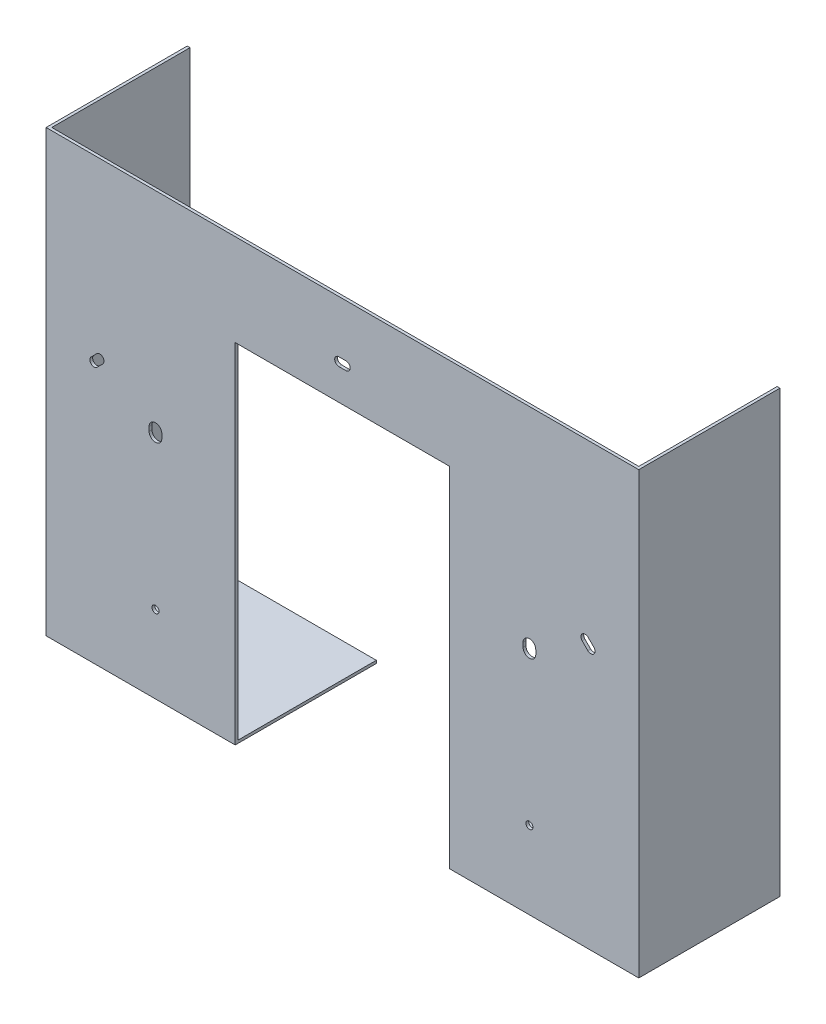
ISO-10303-21;
HEADER;
FILE_DESCRIPTION(('STEP AP214'),'2;1');
FILE_NAME('part.step','',(''),(''),'','','');
FILE_SCHEMA(('AUTOMOTIVE_DESIGN { 1 0 10303 214 1 1 1 1 }'));
ENDSEC;
DATA;
#1=APPLICATION_CONTEXT('core data for automotive mechanical design processes');
#2=APPLICATION_PROTOCOL_DEFINITION('international standard','automotive_design',2000,#1);
#3=PRODUCT_CONTEXT('',#1,'mechanical');
#4=PRODUCT('Part','Part','',(#3));
#5=PRODUCT_RELATED_PRODUCT_CATEGORY('part','',(#4));
#6=PRODUCT_DEFINITION_FORMATION('','',#4);
#7=PRODUCT_DEFINITION_CONTEXT('part definition',#1,'design');
#8=PRODUCT_DEFINITION('design','',#6,#7);
#9=PRODUCT_DEFINITION_SHAPE('','',#8);
#10=(LENGTH_UNIT() NAMED_UNIT(*) SI_UNIT(.MILLI.,.METRE.));
#11=(NAMED_UNIT(*) PLANE_ANGLE_UNIT() SI_UNIT($,.RADIAN.));
#12=(NAMED_UNIT(*) SI_UNIT($,.STERADIAN.) SOLID_ANGLE_UNIT());
#13=UNCERTAINTY_MEASURE_WITH_UNIT(LENGTH_MEASURE(1.E-05),#10,'distance_accuracy_value','');
#14=(GEOMETRIC_REPRESENTATION_CONTEXT(3) GLOBAL_UNCERTAINTY_ASSIGNED_CONTEXT((#13)) GLOBAL_UNIT_ASSIGNED_CONTEXT((#10,
#11,#12)) REPRESENTATION_CONTEXT('',''));
#15=CARTESIAN_POINT('',(0.,0.,0.));
#16=DIRECTION('',(0.,0.,1.));
#17=DIRECTION('',(1.,0.,0.));
#18=AXIS2_PLACEMENT_3D('',#15,#16,#17);
#19=CARTESIAN_POINT('',(0.,312.,0.));
#20=DIRECTION('',(0.,0.,-1.));
#21=DIRECTION('',(-1.,0.,0.));
#22=AXIS2_PLACEMENT_3D('',#19,#20,#21);
#23=PLANE('',#22);
#24=DIRECTION('',(0.,-1.,0.));
#25=VECTOR('',#24,1.);
#26=CARTESIAN_POINT('',(134.,247.,0.));
#27=LINE('',#26,#25);
#28=CARTESIAN_POINT('',(134.,2.,0.));
#29=VERTEX_POINT('',#28);
#30=CARTESIAN_POINT('',(134.,0.,0.));
#31=VERTEX_POINT('',#30);
#32=EDGE_CURVE('E458',#29,#31,#27,.T.);
#33=ORIENTED_EDGE('',*,*,#32,.T.);
#34=DIRECTION('',(1.,0.,0.));
#35=VECTOR('',#34,1.);
#36=CARTESIAN_POINT('',(0.,0.,0.));
#37=LINE('',#36,#35);
#38=CARTESIAN_POINT('',(0.,0.,0.));
#39=VERTEX_POINT('',#38);
#40=EDGE_CURVE('E515',#39,#31,#37,.T.);
#41=ORIENTED_EDGE('',*,*,#40,.F.);
#42=DIRECTION('',(0.,-1.,0.));
#43=VECTOR('',#42,1.);
#44=CARTESIAN_POINT('',(0.,0.,0.));
#45=LINE('',#44,#43);
#46=CARTESIAN_POINT('',(0.,312.,0.));
#47=VERTEX_POINT('',#46);
#48=EDGE_CURVE('E482',#47,#39,#45,.T.);
#49=ORIENTED_EDGE('',*,*,#48,.F.);
#50=DIRECTION('',(-1.,0.,0.));
#51=VECTOR('',#50,1.);
#52=CARTESIAN_POINT('',(0.,312.,0.));
#53=LINE('',#52,#51);
#54=CARTESIAN_POINT('',(2.,312.,0.));
#55=VERTEX_POINT('',#54);
#56=EDGE_CURVE('E520',#55,#47,#53,.T.);
#57=ORIENTED_EDGE('',*,*,#56,.F.);
#58=DIRECTION('',(0.,-1.,0.));
#59=VECTOR('',#58,1.);
#60=CARTESIAN_POINT('',(2.,312.,0.));
#61=LINE('',#60,#59);
#62=CARTESIAN_POINT('',(2.,2.,0.));
#63=VERTEX_POINT('',#62);
#64=EDGE_CURVE('E478',#55,#63,#61,.T.);
#65=ORIENTED_EDGE('',*,*,#64,.T.);
#66=DIRECTION('',(1.,0.,0.));
#67=VECTOR('',#66,1.);
#68=CARTESIAN_POINT('',(0.,2.,0.));
#69=LINE('',#68,#67);
#70=EDGE_CURVE('E509',#63,#29,#69,.T.);
#71=ORIENTED_EDGE('',*,*,#70,.T.);
#72=EDGE_LOOP('',(#33,#41,#49,#57,#65,#71));
#73=FACE_BOUND('',#72,.T.);
#74=ADVANCED_FACE('F26',(#73),#23,.T.);
#75=CARTESIAN_POINT('',(0.,0.,100.));
#76=DIRECTION('',(0.,1.,0.));
#77=DIRECTION('',(0.,0.,1.));
#78=AXIS2_PLACEMENT_3D('',#75,#76,#77);
#79=PLANE('',#78);
#80=DIRECTION('',(0.,0.,-1.));
#81=VECTOR('',#80,1.);
#82=CARTESIAN_POINT('',(79.,0.,76.));
#83=LINE('',#82,#81);
#84=CARTESIAN_POINT('',(79.,0.,76.));
#85=VERTEX_POINT('',#84);
#86=CARTESIAN_POINT('',(79.,0.,67.));
#87=VERTEX_POINT('',#86);
#88=EDGE_CURVE('E324',#85,#87,#83,.T.);
#89=ORIENTED_EDGE('',*,*,#88,.F.);
#90=CARTESIAN_POINT('',(85.,0.,76.));
#91=DIRECTION('',(0.,-1.,0.));
#92=DIRECTION('',(0.,0.,-1.));
#93=AXIS2_PLACEMENT_3D('',#90,#91,#92);
#94=CIRCLE('',#93,6.00000000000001);
#95=CARTESIAN_POINT('',(91.,0.,76.));
#96=VERTEX_POINT('',#95);
#97=EDGE_CURVE('E320',#96,#85,#94,.T.);
#98=ORIENTED_EDGE('',*,*,#97,.F.);
#99=DIRECTION('',(0.,0.,1.));
#100=VECTOR('',#99,1.);
#101=CARTESIAN_POINT('',(91.,0.,76.));
#102=LINE('',#101,#100);
#103=CARTESIAN_POINT('',(91.,0.,67.));
#104=VERTEX_POINT('',#103);
#105=EDGE_CURVE('E330',#104,#96,#102,.T.);
#106=ORIENTED_EDGE('',*,*,#105,.F.);
#107=CARTESIAN_POINT('',(85.,0.,67.));
#108=DIRECTION('',(0.,-1.,0.));
#109=DIRECTION('',(0.,0.,-1.));
#110=AXIS2_PLACEMENT_3D('',#107,#108,#109);
#111=CIRCLE('',#110,6.00000000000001);
#112=EDGE_CURVE('E327',#87,#104,#111,.T.);
#113=ORIENTED_EDGE('',*,*,#112,.F.);
#114=EDGE_LOOP('',(#89,#98,#106,#113));
#115=FACE_BOUND('',#114,.T.);
#116=ORIENTED_EDGE('',*,*,#40,.T.);
#117=DIRECTION('',(0.,0.,1.));
#118=VECTOR('',#117,1.);
#119=CARTESIAN_POINT('',(134.,0.,100.));
#120=LINE('',#119,#118);
#121=CARTESIAN_POINT('',(134.,0.,100.));
#122=VERTEX_POINT('',#121);
#123=EDGE_CURVE('E475',#31,#122,#120,.T.);
#124=ORIENTED_EDGE('',*,*,#123,.T.);
#125=DIRECTION('',(1.,0.,0.));
#126=VECTOR('',#125,1.);
#127=CARTESIAN_POINT('',(0.,0.,100.));
#128=LINE('',#127,#126);
#129=CARTESIAN_POINT('',(0.,0.,100.));
#130=VERTEX_POINT('',#129);
#131=EDGE_CURVE('E528',#130,#122,#128,.T.);
#132=ORIENTED_EDGE('',*,*,#131,.F.);
#133=DIRECTION('',(0.,0.,-1.));
#134=VECTOR('',#133,1.);
#135=CARTESIAN_POINT('',(0.,0.,100.));
#136=LINE('',#135,#134);
#137=EDGE_CURVE('E544',#130,#39,#136,.T.);
#138=ORIENTED_EDGE('',*,*,#137,.T.);
#139=EDGE_LOOP('',(#116,#124,#132,#138));
#140=FACE_BOUND('',#139,.T.);
#141=ADVANCED_FACE('F637',(#115,#140),#79,.F.);
#142=CARTESIAN_POINT('',(0.,2.,100.));
#143=DIRECTION('',(0.,1.,0.));
#144=DIRECTION('',(0.,0.,1.));
#145=AXIS2_PLACEMENT_3D('',#142,#143,#144);
#146=PLANE('',#145);
#147=CARTESIAN_POINT('',(85.,2.,76.));
#148=DIRECTION('',(0.,1.,0.));
#149=DIRECTION('',(0.,0.,1.));
#150=AXIS2_PLACEMENT_3D('',#147,#148,#149);
#151=CIRCLE('',#150,6.00000000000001);
#152=CARTESIAN_POINT('',(79.,2.,76.));
#153=VERTEX_POINT('',#152);
#154=CARTESIAN_POINT('',(91.,2.,76.));
#155=VERTEX_POINT('',#154);
#156=EDGE_CURVE('E610',#153,#155,#151,.T.);
#157=ORIENTED_EDGE('',*,*,#156,.F.);
#158=DIRECTION('',(0.,0.,1.));
#159=VECTOR('',#158,1.);
#160=CARTESIAN_POINT('',(79.,2.,100.));
#161=LINE('',#160,#159);
#162=CARTESIAN_POINT('',(79.,2.,67.));
#163=VERTEX_POINT('',#162);
#164=EDGE_CURVE('E603',#163,#153,#161,.T.);
#165=ORIENTED_EDGE('',*,*,#164,.F.);
#166=CARTESIAN_POINT('',(85.,2.,67.));
#167=DIRECTION('',(0.,1.,0.));
#168=DIRECTION('',(0.,0.,1.));
#169=AXIS2_PLACEMENT_3D('',#166,#167,#168);
#170=CIRCLE('',#169,6.00000000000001);
#171=CARTESIAN_POINT('',(91.,2.,67.));
#172=VERTEX_POINT('',#171);
#173=EDGE_CURVE('E605',#172,#163,#170,.T.);
#174=ORIENTED_EDGE('',*,*,#173,.F.);
#175=DIRECTION('',(0.,0.,-1.));
#176=VECTOR('',#175,1.);
#177=CARTESIAN_POINT('',(91.,2.,100.));
#178=LINE('',#177,#176);
#179=EDGE_CURVE('E608',#155,#172,#178,.T.);
#180=ORIENTED_EDGE('',*,*,#179,.F.);
#181=EDGE_LOOP('',(#157,#165,#174,#180));
#182=FACE_BOUND('',#181,.T.);
#183=DIRECTION('',(0.,0.,1.));
#184=VECTOR('',#183,1.);
#185=CARTESIAN_POINT('',(134.,2.,100.));
#186=LINE('',#185,#184);
#187=CARTESIAN_POINT('',(134.,1.99999999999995,98.));
#188=VERTEX_POINT('',#187);
#189=EDGE_CURVE('E473',#29,#188,#186,.T.);
#190=ORIENTED_EDGE('',*,*,#189,.F.);
#191=ORIENTED_EDGE('',*,*,#70,.F.);
#192=DIRECTION('',(0.,0.,-1.));
#193=VECTOR('',#192,1.);
#194=CARTESIAN_POINT('',(2.,2.,100.));
#195=LINE('',#194,#193);
#196=CARTESIAN_POINT('',(2.,2.,98.));
#197=VERTEX_POINT('',#196);
#198=EDGE_CURVE('E479',#197,#63,#195,.T.);
#199=ORIENTED_EDGE('',*,*,#198,.F.);
#200=DIRECTION('',(1.,0.,0.));
#201=VECTOR('',#200,1.);
#202=CARTESIAN_POINT('',(0.,2.,98.));
#203=LINE('',#202,#201);
#204=EDGE_CURVE('E492',#197,#188,#203,.T.);
#205=ORIENTED_EDGE('',*,*,#204,.T.);
#206=EDGE_LOOP('',(#190,#191,#199,#205));
#207=FACE_BOUND('',#206,.T.);
#208=ADVANCED_FACE('F646',(#182,#207),#146,.T.);
#209=DIRECTION('',(0.,1.,0.));
#210=VECTOR('',#209,1.);
#211=CARTESIAN_POINT('',(286.,247.,0.));
#212=LINE('',#211,#210);
#213=CARTESIAN_POINT('',(286.,0.,0.));
#214=VERTEX_POINT('',#213);
#215=CARTESIAN_POINT('',(286.,2.,0.));
#216=VERTEX_POINT('',#215);
#217=EDGE_CURVE('E461',#214,#216,#212,.T.);
#218=ORIENTED_EDGE('',*,*,#217,.T.);
#219=CARTESIAN_POINT('',(418.,2.,0.));
#220=VERTEX_POINT('',#219);
#221=EDGE_CURVE('E500',#216,#220,#69,.T.);
#222=ORIENTED_EDGE('',*,*,#221,.T.);
#223=DIRECTION('',(0.,1.,0.));
#224=VECTOR('',#223,1.);
#225=CARTESIAN_POINT('',(418.,312.,0.));
#226=LINE('',#225,#224);
#227=CARTESIAN_POINT('',(418.,312.,0.));
#228=VERTEX_POINT('',#227);
#229=EDGE_CURVE('E488',#220,#228,#226,.T.);
#230=ORIENTED_EDGE('',*,*,#229,.T.);
#231=CARTESIAN_POINT('',(420.,312.,0.));
#232=VERTEX_POINT('',#231);
#233=EDGE_CURVE('E521',#232,#228,#53,.T.);
#234=ORIENTED_EDGE('',*,*,#233,.F.);
#235=DIRECTION('',(0.,1.,0.));
#236=VECTOR('',#235,1.);
#237=CARTESIAN_POINT('',(420.,0.,0.));
#238=LINE('',#237,#236);
#239=CARTESIAN_POINT('',(420.,0.,0.));
#240=VERTEX_POINT('',#239);
#241=EDGE_CURVE('E518',#240,#232,#238,.T.);
#242=ORIENTED_EDGE('',*,*,#241,.F.);
#243=EDGE_CURVE('E514',#214,#240,#37,.T.);
#244=ORIENTED_EDGE('',*,*,#243,.F.);
#245=EDGE_LOOP('',(#218,#222,#230,#234,#242,#244));
#246=FACE_BOUND('',#245,.T.);
#247=ADVANCED_FACE('F640',(#246),#23,.T.);
#248=CARTESIAN_POINT('',(0.,0.,100.));
#249=DIRECTION('',(1.,0.,0.));
#250=DIRECTION('',(0.,0.,-1.));
#251=AXIS2_PLACEMENT_3D('',#248,#249,#250);
#252=PLANE('',#251);
#253=ORIENTED_EDGE('',*,*,#48,.T.);
#254=ORIENTED_EDGE('',*,*,#137,.F.);
#255=DIRECTION('',(0.,-1.,0.));
#256=VECTOR('',#255,1.);
#257=CARTESIAN_POINT('',(0.,0.,100.));
#258=LINE('',#257,#256);
#259=CARTESIAN_POINT('',(0.,312.,100.));
#260=VERTEX_POINT('',#259);
#261=EDGE_CURVE('E524',#260,#130,#258,.T.);
#262=ORIENTED_EDGE('',*,*,#261,.F.);
#263=DIRECTION('',(0.,0.,-1.));
#264=VECTOR('',#263,1.);
#265=CARTESIAN_POINT('',(0.,312.,100.));
#266=LINE('',#265,#264);
#267=EDGE_CURVE('E535',#260,#47,#266,.T.);
#268=ORIENTED_EDGE('',*,*,#267,.T.);
#269=EDGE_LOOP('',(#253,#254,#262,#268));
#270=FACE_BOUND('',#269,.T.);
#271=ADVANCED_FACE('F28',(#270),#252,.F.);
#272=DIRECTION('',(0.,0.,-1.));
#273=VECTOR('',#272,1.);
#274=CARTESIAN_POINT('',(329.,0.,76.));
#275=LINE('',#274,#273);
#276=CARTESIAN_POINT('',(329.,0.,76.));
#277=VERTEX_POINT('',#276);
#278=CARTESIAN_POINT('',(329.,0.,67.));
#279=VERTEX_POINT('',#278);
#280=EDGE_CURVE('E306',#277,#279,#275,.T.);
#281=ORIENTED_EDGE('',*,*,#280,.F.);
#282=CARTESIAN_POINT('',(335.,0.,76.));
#283=DIRECTION('',(0.,-1.,0.));
#284=DIRECTION('',(0.,0.,-1.));
#285=AXIS2_PLACEMENT_3D('',#282,#283,#284);
#286=CIRCLE('',#285,6.00000000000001);
#287=CARTESIAN_POINT('',(341.,0.,76.));
#288=VERTEX_POINT('',#287);
#289=EDGE_CURVE('E41',#288,#277,#286,.T.);
#290=ORIENTED_EDGE('',*,*,#289,.F.);
#291=DIRECTION('',(0.,0.,1.));
#292=VECTOR('',#291,1.);
#293=CARTESIAN_POINT('',(341.,0.,76.));
#294=LINE('',#293,#292);
#295=CARTESIAN_POINT('',(341.,0.,67.));
#296=VERTEX_POINT('',#295);
#297=EDGE_CURVE('E313',#296,#288,#294,.T.);
#298=ORIENTED_EDGE('',*,*,#297,.F.);
#299=CARTESIAN_POINT('',(335.,0.,67.));
#300=DIRECTION('',(0.,-1.,0.));
#301=DIRECTION('',(0.,0.,-1.));
#302=AXIS2_PLACEMENT_3D('',#299,#300,#301);
#303=CIRCLE('',#302,6.00000000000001);
#304=EDGE_CURVE('E297',#279,#296,#303,.T.);
#305=ORIENTED_EDGE('',*,*,#304,.F.);
#306=EDGE_LOOP('',(#281,#290,#298,#305));
#307=FACE_BOUND('',#306,.T.);
#308=CARTESIAN_POINT('',(286.,0.,100.));
#309=VERTEX_POINT('',#308);
#310=CARTESIAN_POINT('',(420.,0.,100.));
#311=VERTEX_POINT('',#310);
#312=EDGE_CURVE('E527',#309,#311,#128,.T.);
#313=ORIENTED_EDGE('',*,*,#312,.F.);
#314=DIRECTION('',(0.,0.,-1.));
#315=VECTOR('',#314,1.);
#316=CARTESIAN_POINT('',(286.,0.,100.));
#317=LINE('',#316,#315);
#318=EDGE_CURVE('E470',#309,#214,#317,.T.);
#319=ORIENTED_EDGE('',*,*,#318,.T.);
#320=ORIENTED_EDGE('',*,*,#243,.T.);
#321=DIRECTION('',(0.,0.,-1.));
#322=VECTOR('',#321,1.);
#323=CARTESIAN_POINT('',(420.,0.,100.));
#324=LINE('',#323,#322);
#325=EDGE_CURVE('E541',#311,#240,#324,.T.);
#326=ORIENTED_EDGE('',*,*,#325,.F.);
#327=EDGE_LOOP('',(#313,#319,#320,#326));
#328=FACE_BOUND('',#327,.T.);
#329=ADVANCED_FACE('F310',(#307,#328),#79,.F.);
#330=CARTESIAN_POINT('',(420.,0.,100.));
#331=DIRECTION('',(-1.,0.,0.));
#332=DIRECTION('',(0.,0.,1.));
#333=AXIS2_PLACEMENT_3D('',#330,#331,#332);
#334=PLANE('',#333);
#335=ORIENTED_EDGE('',*,*,#241,.T.);
#336=DIRECTION('',(0.,0.,-1.));
#337=VECTOR('',#336,1.);
#338=CARTESIAN_POINT('',(420.,312.,100.));
#339=LINE('',#338,#337);
#340=CARTESIAN_POINT('',(420.,312.,100.));
#341=VERTEX_POINT('',#340);
#342=EDGE_CURVE('E538',#341,#232,#339,.T.);
#343=ORIENTED_EDGE('',*,*,#342,.F.);
#344=DIRECTION('',(0.,1.,0.));
#345=VECTOR('',#344,1.);
#346=CARTESIAN_POINT('',(420.,0.,100.));
#347=LINE('',#346,#345);
#348=EDGE_CURVE('E531',#311,#341,#347,.T.);
#349=ORIENTED_EDGE('',*,*,#348,.F.);
#350=ORIENTED_EDGE('',*,*,#325,.T.);
#351=EDGE_LOOP('',(#335,#343,#349,#350));
#352=FACE_BOUND('',#351,.T.);
#353=ADVANCED_FACE('F682',(#352),#334,.F.);
#354=CARTESIAN_POINT('',(0.,312.,100.));
#355=DIRECTION('',(0.,-1.,0.));
#356=DIRECTION('',(0.,0.,-1.));
#357=AXIS2_PLACEMENT_3D('',#354,#355,#356);
#358=PLANE('',#357);
#359=DIRECTION('',(-1.,0.,0.));
#360=VECTOR('',#359,1.);
#361=CARTESIAN_POINT('',(0.,312.,98.));
#362=LINE('',#361,#360);
#363=CARTESIAN_POINT('',(418.,312.,98.));
#364=VERTEX_POINT('',#363);
#365=CARTESIAN_POINT('',(2.,312.,98.));
#366=VERTEX_POINT('',#365);
#367=EDGE_CURVE('E497',#364,#366,#362,.T.);
#368=ORIENTED_EDGE('',*,*,#367,.T.);
#369=DIRECTION('',(0.,0.,-1.));
#370=VECTOR('',#369,1.);
#371=CARTESIAN_POINT('',(2.,312.,100.));
#372=LINE('',#371,#370);
#373=EDGE_CURVE('E501',#366,#55,#372,.T.);
#374=ORIENTED_EDGE('',*,*,#373,.T.);
#375=ORIENTED_EDGE('',*,*,#56,.T.);
#376=ORIENTED_EDGE('',*,*,#267,.F.);
#377=DIRECTION('',(-1.,0.,0.));
#378=VECTOR('',#377,1.);
#379=CARTESIAN_POINT('',(0.,312.,100.));
#380=LINE('',#379,#378);
#381=EDGE_CURVE('E533',#341,#260,#380,.T.);
#382=ORIENTED_EDGE('',*,*,#381,.F.);
#383=ORIENTED_EDGE('',*,*,#342,.T.);
#384=ORIENTED_EDGE('',*,*,#233,.T.);
#385=DIRECTION('',(0.,0.,-1.));
#386=VECTOR('',#385,1.);
#387=CARTESIAN_POINT('',(418.,312.,100.));
#388=LINE('',#387,#386);
#389=EDGE_CURVE('E491',#364,#228,#388,.T.);
#390=ORIENTED_EDGE('',*,*,#389,.F.);
#391=EDGE_LOOP('',(#368,#374,#375,#376,#382,#383,#384,#390));
#392=FACE_BOUND('',#391,.T.);
#393=ADVANCED_FACE('F678',(#392),#358,.F.);
#394=CARTESIAN_POINT('',(0.,312.,100.));
#395=DIRECTION('',(0.,0.,-1.));
#396=DIRECTION('',(-1.,0.,0.));
#397=AXIS2_PLACEMENT_3D('',#394,#395,#396);
#398=PLANE('',#397);
#399=DIRECTION('',(0.707106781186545,0.70710678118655,0.));
#400=VECTOR('',#399,1.);
#401=CARTESIAN_POINT('',(36.1213203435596,182.87867965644,100.));
#402=LINE('',#401,#400);
#403=CARTESIAN_POINT('',(36.1213203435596,182.87867965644,100.));
#404=VERTEX_POINT('',#403);
#405=CARTESIAN_POINT('',(40.1213203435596,186.87867965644,100.));
#406=VERTEX_POINT('',#405);
#407=EDGE_CURVE('E344',#404,#406,#402,.T.);
#408=ORIENTED_EDGE('',*,*,#407,.F.);
#409=CARTESIAN_POINT('',(34.,185.,100.));
#410=DIRECTION('',(0.,0.,1.));
#411=DIRECTION('',(1.,0.,0.));
#412=AXIS2_PLACEMENT_3D('',#409,#410,#411);
#413=CIRCLE('',#412,3.);
#414=CARTESIAN_POINT('',(31.8786796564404,187.12132034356,100.));
#415=VERTEX_POINT('',#414);
#416=EDGE_CURVE('E336',#415,#404,#413,.T.);
#417=ORIENTED_EDGE('',*,*,#416,.F.);
#418=DIRECTION('',(-0.707106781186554,-0.707106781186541,0.));
#419=VECTOR('',#418,1.);
#420=CARTESIAN_POINT('',(31.8786796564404,187.12132034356,100.));
#421=LINE('',#420,#419);
#422=CARTESIAN_POINT('',(35.8786796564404,191.12132034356,100.));
#423=VERTEX_POINT('',#422);
#424=EDGE_CURVE('E350',#423,#415,#421,.T.);
#425=ORIENTED_EDGE('',*,*,#424,.F.);
#426=CARTESIAN_POINT('',(38.,189.,100.));
#427=DIRECTION('',(0.,0.,1.));
#428=DIRECTION('',(1.,0.,0.));
#429=AXIS2_PLACEMENT_3D('',#426,#427,#428);
#430=CIRCLE('',#429,2.99999999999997);
#431=EDGE_CURVE('E347',#406,#423,#430,.T.);
#432=ORIENTED_EDGE('',*,*,#431,.F.);
#433=EDGE_LOOP('',(#408,#417,#425,#432));
#434=FACE_BOUND('',#433,.T.);
#435=DIRECTION('',(-0.707106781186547,0.707106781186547,0.));
#436=VECTOR('',#435,1.);
#437=CARTESIAN_POINT('',(388.12132034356,187.12132034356,100.));
#438=LINE('',#437,#436);
#439=CARTESIAN_POINT('',(388.12132034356,187.12132034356,100.));
#440=VERTEX_POINT('',#439);
#441=CARTESIAN_POINT('',(384.12132034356,191.12132034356,100.));
#442=VERTEX_POINT('',#441);
#443=EDGE_CURVE('E364',#440,#442,#438,.T.);
#444=ORIENTED_EDGE('',*,*,#443,.F.);
#445=CARTESIAN_POINT('',(386.,185.,100.));
#446=DIRECTION('',(0.,0.,1.));
#447=DIRECTION('',(-1.,0.,0.));
#448=AXIS2_PLACEMENT_3D('',#445,#446,#447);
#449=CIRCLE('',#448,3.);
#450=CARTESIAN_POINT('',(383.87867965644,182.87867965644,100.));
#451=VERTEX_POINT('',#450);
#452=EDGE_CURVE('E356',#451,#440,#449,.T.);
#453=ORIENTED_EDGE('',*,*,#452,.F.);
#454=DIRECTION('',(0.707106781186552,-0.707106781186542,0.));
#455=VECTOR('',#454,1.);
#456=CARTESIAN_POINT('',(383.87867965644,182.87867965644,100.));
#457=LINE('',#456,#455);
#458=CARTESIAN_POINT('',(379.87867965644,186.87867965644,100.));
#459=VERTEX_POINT('',#458);
#460=EDGE_CURVE('E370',#459,#451,#457,.T.);
#461=ORIENTED_EDGE('',*,*,#460,.F.);
#462=CARTESIAN_POINT('',(382.,189.,100.));
#463=DIRECTION('',(0.,0.,1.));
#464=DIRECTION('',(-1.,0.,0.));
#465=AXIS2_PLACEMENT_3D('',#462,#463,#464);
#466=CIRCLE('',#465,3.00000000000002);
#467=EDGE_CURVE('E367',#442,#459,#466,.T.);
#468=ORIENTED_EDGE('',*,*,#467,.F.);
#469=EDGE_LOOP('',(#444,#453,#461,#468));
#470=FACE_BOUND('',#469,.T.);
#471=DIRECTION('',(1.,0.,0.));
#472=VECTOR('',#471,1.);
#473=CARTESIAN_POINT('',(207.5,269.,100.));
#474=LINE('',#473,#472);
#475=CARTESIAN_POINT('',(207.5,269.,100.));
#476=VERTEX_POINT('',#475);
#477=CARTESIAN_POINT('',(212.5,269.,100.));
#478=VERTEX_POINT('',#477);
#479=EDGE_CURVE('E384',#476,#478,#474,.T.);
#480=ORIENTED_EDGE('',*,*,#479,.F.);
#481=CARTESIAN_POINT('',(207.5,272.,100.));
#482=DIRECTION('',(0.,0.,1.));
#483=DIRECTION('',(1.,0.,0.));
#484=AXIS2_PLACEMENT_3D('',#481,#482,#483);
#485=CIRCLE('',#484,3.);
#486=CARTESIAN_POINT('',(207.5,275.,100.));
#487=VERTEX_POINT('',#486);
#488=EDGE_CURVE('E376',#487,#476,#485,.T.);
#489=ORIENTED_EDGE('',*,*,#488,.F.);
#490=DIRECTION('',(-1.,0.,0.));
#491=VECTOR('',#490,1.);
#492=CARTESIAN_POINT('',(207.5,275.,100.));
#493=LINE('',#492,#491);
#494=CARTESIAN_POINT('',(212.5,275.,100.));
#495=VERTEX_POINT('',#494);
#496=EDGE_CURVE('E390',#495,#487,#493,.T.);
#497=ORIENTED_EDGE('',*,*,#496,.F.);
#498=CARTESIAN_POINT('',(212.5,272.,100.));
#499=DIRECTION('',(0.,0.,1.));
#500=DIRECTION('',(1.,0.,0.));
#501=AXIS2_PLACEMENT_3D('',#498,#499,#500);
#502=CIRCLE('',#501,3.);
#503=EDGE_CURVE('E387',#478,#495,#502,.T.);
#504=ORIENTED_EDGE('',*,*,#503,.F.);
#505=EDGE_LOOP('',(#480,#489,#497,#504));
#506=FACE_BOUND('',#505,.T.);
#507=DIRECTION('',(0.,-1.,0.));
#508=VECTOR('',#507,1.);
#509=CARTESIAN_POINT('',(338.,165.,100.));
#510=LINE('',#509,#508);
#511=CARTESIAN_POINT('',(338.,165.,100.));
#512=VERTEX_POINT('',#511);
#513=CARTESIAN_POINT('',(338.,162.,100.));
#514=VERTEX_POINT('',#513);
#515=EDGE_CURVE('E404',#512,#514,#510,.T.);
#516=ORIENTED_EDGE('',*,*,#515,.F.);
#517=CARTESIAN_POINT('',(342.5,165.,100.));
#518=DIRECTION('',(0.,0.,1.));
#519=DIRECTION('',(1.,0.,0.));
#520=AXIS2_PLACEMENT_3D('',#517,#518,#519);
#521=CIRCLE('',#520,4.5);
#522=CARTESIAN_POINT('',(347.,165.,100.));
#523=VERTEX_POINT('',#522);
#524=EDGE_CURVE('E396',#523,#512,#521,.T.);
#525=ORIENTED_EDGE('',*,*,#524,.F.);
#526=DIRECTION('',(0.,1.,0.));
#527=VECTOR('',#526,1.);
#528=CARTESIAN_POINT('',(347.,165.,100.));
#529=LINE('',#528,#527);
#530=CARTESIAN_POINT('',(347.,162.,100.));
#531=VERTEX_POINT('',#530);
#532=EDGE_CURVE('E410',#531,#523,#529,.T.);
#533=ORIENTED_EDGE('',*,*,#532,.F.);
#534=CARTESIAN_POINT('',(342.5,162.,100.));
#535=DIRECTION('',(0.,0.,1.));
#536=DIRECTION('',(1.,0.,0.));
#537=AXIS2_PLACEMENT_3D('',#534,#535,#536);
#538=CIRCLE('',#537,4.5);
#539=EDGE_CURVE('E407',#514,#531,#538,.T.);
#540=ORIENTED_EDGE('',*,*,#539,.F.);
#541=EDGE_LOOP('',(#516,#525,#533,#540));
#542=FACE_BOUND('',#541,.T.);
#543=DIRECTION('',(0.,-1.,0.));
#544=VECTOR('',#543,1.);
#545=CARTESIAN_POINT('',(73.,165.,100.));
#546=LINE('',#545,#544);
#547=CARTESIAN_POINT('',(73.,165.,100.));
#548=VERTEX_POINT('',#547);
#549=CARTESIAN_POINT('',(73.,162.,100.));
#550=VERTEX_POINT('',#549);
#551=EDGE_CURVE('E424',#548,#550,#546,.T.);
#552=ORIENTED_EDGE('',*,*,#551,.F.);
#553=CARTESIAN_POINT('',(77.5,165.,100.));
#554=DIRECTION('',(0.,0.,1.));
#555=DIRECTION('',(1.,0.,0.));
#556=AXIS2_PLACEMENT_3D('',#553,#554,#555);
#557=CIRCLE('',#556,4.5);
#558=CARTESIAN_POINT('',(82.,165.,100.));
#559=VERTEX_POINT('',#558);
#560=EDGE_CURVE('E416',#559,#548,#557,.T.);
#561=ORIENTED_EDGE('',*,*,#560,.F.);
#562=DIRECTION('',(0.,1.,0.));
#563=VECTOR('',#562,1.);
#564=CARTESIAN_POINT('',(82.,165.,100.));
#565=LINE('',#564,#563);
#566=CARTESIAN_POINT('',(82.,162.,100.));
#567=VERTEX_POINT('',#566);
#568=EDGE_CURVE('E430',#567,#559,#565,.T.);
#569=ORIENTED_EDGE('',*,*,#568,.F.);
#570=CARTESIAN_POINT('',(77.5,162.,100.));
#571=DIRECTION('',(0.,0.,1.));
#572=DIRECTION('',(1.,0.,0.));
#573=AXIS2_PLACEMENT_3D('',#570,#571,#572);
#574=CIRCLE('',#573,4.5);
#575=EDGE_CURVE('E427',#550,#567,#574,.T.);
#576=ORIENTED_EDGE('',*,*,#575,.F.);
#577=EDGE_LOOP('',(#552,#561,#569,#576));
#578=FACE_BOUND('',#577,.T.);
#579=CARTESIAN_POINT('',(342.5,55.,100.));
#580=DIRECTION('',(0.,0.,1.));
#581=DIRECTION('',(1.,0.,0.));
#582=AXIS2_PLACEMENT_3D('',#579,#580,#581);
#583=CIRCLE('',#582,2.50000000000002);
#584=CARTESIAN_POINT('',(345.,55.,100.));
#585=VERTEX_POINT('',#584);
#586=EDGE_CURVE('E436',#585,#585,#583,.T.);
#587=ORIENTED_EDGE('',*,*,#586,.F.);
#588=EDGE_LOOP('',(#587));
#589=FACE_BOUND('',#588,.T.);
#590=CARTESIAN_POINT('',(77.5,55.,100.));
#591=DIRECTION('',(0.,0.,1.));
#592=DIRECTION('',(1.,0.,0.));
#593=AXIS2_PLACEMENT_3D('',#590,#591,#592);
#594=CIRCLE('',#593,2.50000000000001);
#595=CARTESIAN_POINT('',(80.,55.,100.));
#596=VERTEX_POINT('',#595);
#597=EDGE_CURVE('E446',#596,#596,#594,.T.);
#598=ORIENTED_EDGE('',*,*,#597,.F.);
#599=EDGE_LOOP('',(#598));
#600=FACE_BOUND('',#599,.T.);
#601=ORIENTED_EDGE('',*,*,#131,.T.);
#602=DIRECTION('',(0.,-1.,0.));
#603=VECTOR('',#602,1.);
#604=CARTESIAN_POINT('',(134.,247.,100.));
#605=LINE('',#604,#603);
#606=CARTESIAN_POINT('',(134.,247.,100.));
#607=VERTEX_POINT('',#606);
#608=EDGE_CURVE('E450',#607,#122,#605,.T.);
#609=ORIENTED_EDGE('',*,*,#608,.F.);
#610=DIRECTION('',(-1.,0.,0.));
#611=VECTOR('',#610,1.);
#612=CARTESIAN_POINT('',(134.,247.,100.));
#613=LINE('',#612,#611);
#614=CARTESIAN_POINT('',(286.,247.,100.));
#615=VERTEX_POINT('',#614);
#616=EDGE_CURVE('E455',#615,#607,#613,.T.);
#617=ORIENTED_EDGE('',*,*,#616,.F.);
#618=DIRECTION('',(0.,1.,0.));
#619=VECTOR('',#618,1.);
#620=CARTESIAN_POINT('',(286.,247.,100.));
#621=LINE('',#620,#619);
#622=EDGE_CURVE('E452',#309,#615,#621,.T.);
#623=ORIENTED_EDGE('',*,*,#622,.F.);
#624=ORIENTED_EDGE('',*,*,#312,.T.);
#625=ORIENTED_EDGE('',*,*,#348,.T.);
#626=ORIENTED_EDGE('',*,*,#381,.T.);
#627=ORIENTED_EDGE('',*,*,#261,.T.);
#628=EDGE_LOOP('',(#601,#609,#617,#623,#624,#625,#626,#627));
#629=FACE_BOUND('',#628,.T.);
#630=ADVANCED_FACE('F689',(#434,#470,#506,#542,#578,#589,#600,#629),#398,.F.);
#631=CARTESIAN_POINT('',(2.,0.,100.));
#632=DIRECTION('',(1.,0.,0.));
#633=DIRECTION('',(0.,0.,-1.));
#634=AXIS2_PLACEMENT_3D('',#631,#632,#633);
#635=PLANE('',#634);
#636=ORIENTED_EDGE('',*,*,#64,.F.);
#637=ORIENTED_EDGE('',*,*,#373,.F.);
#638=DIRECTION('',(0.,-1.,0.));
#639=VECTOR('',#638,1.);
#640=CARTESIAN_POINT('',(2.,312.,98.));
#641=LINE('',#640,#639);
#642=EDGE_CURVE('E484',#366,#197,#641,.T.);
#643=ORIENTED_EDGE('',*,*,#642,.T.);
#644=ORIENTED_EDGE('',*,*,#198,.T.);
#645=EDGE_LOOP('',(#636,#637,#643,#644));
#646=FACE_BOUND('',#645,.T.);
#647=ADVANCED_FACE('F705',(#646),#635,.T.);
#648=CARTESIAN_POINT('',(335.,2.,76.));
#649=DIRECTION('',(0.,1.,0.));
#650=DIRECTION('',(0.,0.,1.));
#651=AXIS2_PLACEMENT_3D('',#648,#649,#650);
#652=CIRCLE('',#651,6.00000000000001);
#653=CARTESIAN_POINT('',(329.,2.,76.));
#654=VERTEX_POINT('',#653);
#655=CARTESIAN_POINT('',(341.,2.,76.));
#656=VERTEX_POINT('',#655);
#657=EDGE_CURVE('E11',#654,#656,#652,.T.);
#658=ORIENTED_EDGE('',*,*,#657,.F.);
#659=DIRECTION('',(0.,0.,1.));
#660=VECTOR('',#659,1.);
#661=CARTESIAN_POINT('',(329.,2.,100.));
#662=LINE('',#661,#660);
#663=CARTESIAN_POINT('',(329.,2.,67.));
#664=VERTEX_POINT('',#663);
#665=EDGE_CURVE('E612',#664,#654,#662,.T.);
#666=ORIENTED_EDGE('',*,*,#665,.F.);
#667=CARTESIAN_POINT('',(335.,2.,67.));
#668=DIRECTION('',(0.,1.,0.));
#669=DIRECTION('',(0.,0.,1.));
#670=AXIS2_PLACEMENT_3D('',#667,#668,#669);
#671=CIRCLE('',#670,6.00000000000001);
#672=CARTESIAN_POINT('',(341.,2.,67.));
#673=VERTEX_POINT('',#672);
#674=EDGE_CURVE('E300',#673,#664,#671,.T.);
#675=ORIENTED_EDGE('',*,*,#674,.F.);
#676=DIRECTION('',(0.,0.,-1.));
#677=VECTOR('',#676,1.);
#678=CARTESIAN_POINT('',(341.,2.,100.));
#679=LINE('',#678,#677);
#680=EDGE_CURVE('E34',#656,#673,#679,.T.);
#681=ORIENTED_EDGE('',*,*,#680,.F.);
#682=EDGE_LOOP('',(#658,#666,#675,#681));
#683=FACE_BOUND('',#682,.T.);
#684=DIRECTION('',(0.,0.,-1.));
#685=VECTOR('',#684,1.);
#686=CARTESIAN_POINT('',(286.,2.,100.));
#687=LINE('',#686,#685);
#688=CARTESIAN_POINT('',(286.,1.99999999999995,98.));
#689=VERTEX_POINT('',#688);
#690=EDGE_CURVE('E467',#689,#216,#687,.T.);
#691=ORIENTED_EDGE('',*,*,#690,.F.);
#692=CARTESIAN_POINT('',(418.,2.,98.));
#693=VERTEX_POINT('',#692);
#694=EDGE_CURVE('E487',#689,#693,#203,.T.);
#695=ORIENTED_EDGE('',*,*,#694,.T.);
#696=DIRECTION('',(0.,0.,-1.));
#697=VECTOR('',#696,1.);
#698=CARTESIAN_POINT('',(418.,2.,100.));
#699=LINE('',#698,#697);
#700=EDGE_CURVE('E483',#693,#220,#699,.T.);
#701=ORIENTED_EDGE('',*,*,#700,.T.);
#702=ORIENTED_EDGE('',*,*,#221,.F.);
#703=EDGE_LOOP('',(#691,#695,#701,#702));
#704=FACE_BOUND('',#703,.T.);
#705=ADVANCED_FACE('F620',(#683,#704),#146,.T.);
#706=CARTESIAN_POINT('',(418.,0.,100.));
#707=DIRECTION('',(-1.,0.,0.));
#708=DIRECTION('',(0.,0.,1.));
#709=AXIS2_PLACEMENT_3D('',#706,#707,#708);
#710=PLANE('',#709);
#711=ORIENTED_EDGE('',*,*,#229,.F.);
#712=ORIENTED_EDGE('',*,*,#700,.F.);
#713=DIRECTION('',(0.,1.,0.));
#714=VECTOR('',#713,1.);
#715=CARTESIAN_POINT('',(418.,312.,98.));
#716=LINE('',#715,#714);
#717=EDGE_CURVE('E495',#693,#364,#716,.T.);
#718=ORIENTED_EDGE('',*,*,#717,.T.);
#719=ORIENTED_EDGE('',*,*,#389,.T.);
#720=EDGE_LOOP('',(#711,#712,#718,#719));
#721=FACE_BOUND('',#720,.T.);
#722=ADVANCED_FACE('F669',(#721),#710,.T.);
#723=CARTESIAN_POINT('',(0.,312.,98.));
#724=DIRECTION('',(0.,0.,-1.));
#725=DIRECTION('',(-1.,0.,0.));
#726=AXIS2_PLACEMENT_3D('',#723,#724,#725);
#727=PLANE('',#726);
#728=CARTESIAN_POINT('',(34.,185.,98.));
#729=DIRECTION('',(0.,0.,-1.));
#730=DIRECTION('',(-1.,0.,0.));
#731=AXIS2_PLACEMENT_3D('',#728,#729,#730);
#732=CIRCLE('',#731,3.);
#733=CARTESIAN_POINT('',(36.1213203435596,182.87867965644,98.));
#734=VERTEX_POINT('',#733);
#735=CARTESIAN_POINT('',(31.8786796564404,187.12132034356,98.));
#736=VERTEX_POINT('',#735);
#737=EDGE_CURVE('E601',#734,#736,#732,.T.);
#738=ORIENTED_EDGE('',*,*,#737,.F.);
#739=DIRECTION('',(-0.707106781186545,-0.70710678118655,0.));
#740=VECTOR('',#739,1.);
#741=CARTESIAN_POINT('',(82.6213203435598,229.378679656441,98.));
#742=LINE('',#741,#740);
#743=CARTESIAN_POINT('',(40.1213203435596,186.87867965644,98.));
#744=VERTEX_POINT('',#743);
#745=EDGE_CURVE('E594',#744,#734,#742,.T.);
#746=ORIENTED_EDGE('',*,*,#745,.F.);
#747=CARTESIAN_POINT('',(38.,189.,98.));
#748=DIRECTION('',(0.,0.,-1.));
#749=DIRECTION('',(-1.,0.,0.));
#750=AXIS2_PLACEMENT_3D('',#747,#748,#749);
#751=CIRCLE('',#750,2.99999999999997);
#752=CARTESIAN_POINT('',(35.8786796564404,191.12132034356,98.));
#753=VERTEX_POINT('',#752);
#754=EDGE_CURVE('E596',#753,#744,#751,.T.);
#755=ORIENTED_EDGE('',*,*,#754,.F.);
#756=DIRECTION('',(0.707106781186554,0.707106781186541,0.));
#757=VECTOR('',#756,1.);
#758=CARTESIAN_POINT('',(78.3786796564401,233.621320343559,98.));
#759=LINE('',#758,#757);
#760=EDGE_CURVE('E599',#736,#753,#759,.T.);
#761=ORIENTED_EDGE('',*,*,#760,.F.);
#762=EDGE_LOOP('',(#738,#746,#755,#761));
#763=FACE_BOUND('',#762,.T.);
#764=CARTESIAN_POINT('',(386.,185.,98.));
#765=DIRECTION('',(0.,0.,-1.));
#766=DIRECTION('',(-1.,0.,0.));
#767=AXIS2_PLACEMENT_3D('',#764,#765,#766);
#768=CIRCLE('',#767,3.);
#769=CARTESIAN_POINT('',(388.12132034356,187.12132034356,98.));
#770=VERTEX_POINT('',#769);
#771=CARTESIAN_POINT('',(383.87867965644,182.87867965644,98.));
#772=VERTEX_POINT('',#771);
#773=EDGE_CURVE('E592',#770,#772,#768,.T.);
#774=ORIENTED_EDGE('',*,*,#773,.F.);
#775=DIRECTION('',(0.707106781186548,-0.707106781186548,0.));
#776=VECTOR('',#775,1.);
#777=CARTESIAN_POINT('',(131.62132034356,443.62132034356,98.));
#778=LINE('',#777,#776);
#779=CARTESIAN_POINT('',(384.12132034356,191.12132034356,98.));
#780=VERTEX_POINT('',#779);
#781=EDGE_CURVE('E585',#780,#770,#778,.T.);
#782=ORIENTED_EDGE('',*,*,#781,.F.);
#783=CARTESIAN_POINT('',(382.,189.,98.));
#784=DIRECTION('',(0.,0.,-1.));
#785=DIRECTION('',(-1.,0.,0.));
#786=AXIS2_PLACEMENT_3D('',#783,#784,#785);
#787=CIRCLE('',#786,3.00000000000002);
#788=CARTESIAN_POINT('',(379.87867965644,186.87867965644,98.));
#789=VERTEX_POINT('',#788);
#790=EDGE_CURVE('E587',#789,#780,#787,.T.);
#791=ORIENTED_EDGE('',*,*,#790,.F.);
#792=DIRECTION('',(-0.707106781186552,0.707106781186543,0.));
#793=VECTOR('',#792,1.);
#794=CARTESIAN_POINT('',(127.378679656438,439.378679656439,98.));
#795=LINE('',#794,#793);
#796=EDGE_CURVE('E590',#772,#789,#795,.T.);
#797=ORIENTED_EDGE('',*,*,#796,.F.);
#798=EDGE_LOOP('',(#774,#782,#791,#797));
#799=FACE_BOUND('',#798,.T.);
#800=CARTESIAN_POINT('',(207.5,272.,98.));
#801=DIRECTION('',(0.,0.,-1.));
#802=DIRECTION('',(-1.,0.,0.));
#803=AXIS2_PLACEMENT_3D('',#800,#801,#802);
#804=CIRCLE('',#803,3.);
#805=CARTESIAN_POINT('',(207.5,269.,98.));
#806=VERTEX_POINT('',#805);
#807=CARTESIAN_POINT('',(207.5,275.,98.));
#808=VERTEX_POINT('',#807);
#809=EDGE_CURVE('E583',#806,#808,#804,.T.);
#810=ORIENTED_EDGE('',*,*,#809,.F.);
#811=DIRECTION('',(-1.,0.,0.));
#812=VECTOR('',#811,1.);
#813=CARTESIAN_POINT('',(0.,269.,98.));
#814=LINE('',#813,#812);
#815=CARTESIAN_POINT('',(212.5,269.,98.));
#816=VERTEX_POINT('',#815);
#817=EDGE_CURVE('E576',#816,#806,#814,.T.);
#818=ORIENTED_EDGE('',*,*,#817,.F.);
#819=CARTESIAN_POINT('',(212.5,272.,98.));
#820=DIRECTION('',(0.,0.,-1.));
#821=DIRECTION('',(-1.,0.,0.));
#822=AXIS2_PLACEMENT_3D('',#819,#820,#821);
#823=CIRCLE('',#822,3.);
#824=CARTESIAN_POINT('',(212.5,275.,98.));
#825=VERTEX_POINT('',#824);
#826=EDGE_CURVE('E578',#825,#816,#823,.T.);
#827=ORIENTED_EDGE('',*,*,#826,.F.);
#828=DIRECTION('',(1.,0.,0.));
#829=VECTOR('',#828,1.);
#830=CARTESIAN_POINT('',(0.,275.,98.));
#831=LINE('',#830,#829);
#832=EDGE_CURVE('E581',#808,#825,#831,.T.);
#833=ORIENTED_EDGE('',*,*,#832,.F.);
#834=EDGE_LOOP('',(#810,#818,#827,#833));
#835=FACE_BOUND('',#834,.T.);
#836=CARTESIAN_POINT('',(342.5,165.,98.));
#837=DIRECTION('',(0.,0.,-1.));
#838=DIRECTION('',(-1.,0.,0.));
#839=AXIS2_PLACEMENT_3D('',#836,#837,#838);
#840=CIRCLE('',#839,4.5);
#841=CARTESIAN_POINT('',(338.,165.,98.));
#842=VERTEX_POINT('',#841);
#843=CARTESIAN_POINT('',(347.,165.,98.));
#844=VERTEX_POINT('',#843);
#845=EDGE_CURVE('E574',#842,#844,#840,.T.);
#846=ORIENTED_EDGE('',*,*,#845,.F.);
#847=DIRECTION('',(0.,1.,0.));
#848=VECTOR('',#847,1.);
#849=CARTESIAN_POINT('',(338.,312.,98.));
#850=LINE('',#849,#848);
#851=CARTESIAN_POINT('',(338.,162.,98.));
#852=VERTEX_POINT('',#851);
#853=EDGE_CURVE('E567',#852,#842,#850,.T.);
#854=ORIENTED_EDGE('',*,*,#853,.F.);
#855=CARTESIAN_POINT('',(342.5,162.,98.));
#856=DIRECTION('',(0.,0.,-1.));
#857=DIRECTION('',(-1.,0.,0.));
#858=AXIS2_PLACEMENT_3D('',#855,#856,#857);
#859=CIRCLE('',#858,4.5);
#860=CARTESIAN_POINT('',(347.,162.,98.));
#861=VERTEX_POINT('',#860);
#862=EDGE_CURVE('E569',#861,#852,#859,.T.);
#863=ORIENTED_EDGE('',*,*,#862,.F.);
#864=DIRECTION('',(0.,-1.,0.));
#865=VECTOR('',#864,1.);
#866=CARTESIAN_POINT('',(347.,312.,98.));
#867=LINE('',#866,#865);
#868=EDGE_CURVE('E572',#844,#861,#867,.T.);
#869=ORIENTED_EDGE('',*,*,#868,.F.);
#870=EDGE_LOOP('',(#846,#854,#863,#869));
#871=FACE_BOUND('',#870,.T.);
#872=CARTESIAN_POINT('',(77.5,165.,98.));
#873=DIRECTION('',(0.,0.,-1.));
#874=DIRECTION('',(-1.,0.,0.));
#875=AXIS2_PLACEMENT_3D('',#872,#873,#874);
#876=CIRCLE('',#875,4.5);
#877=CARTESIAN_POINT('',(73.,165.,98.));
#878=VERTEX_POINT('',#877);
#879=CARTESIAN_POINT('',(82.,165.,98.));
#880=VERTEX_POINT('',#879);
#881=EDGE_CURVE('E565',#878,#880,#876,.T.);
#882=ORIENTED_EDGE('',*,*,#881,.F.);
#883=DIRECTION('',(0.,1.,0.));
#884=VECTOR('',#883,1.);
#885=CARTESIAN_POINT('',(73.,312.,98.));
#886=LINE('',#885,#884);
#887=CARTESIAN_POINT('',(73.,162.,98.));
#888=VERTEX_POINT('',#887);
#889=EDGE_CURVE('E554',#888,#878,#886,.T.);
#890=ORIENTED_EDGE('',*,*,#889,.F.);
#891=CARTESIAN_POINT('',(77.5,162.,98.));
#892=DIRECTION('',(0.,0.,-1.));
#893=DIRECTION('',(-1.,0.,0.));
#894=AXIS2_PLACEMENT_3D('',#891,#892,#893);
#895=CIRCLE('',#894,4.5);
#896=CARTESIAN_POINT('',(82.,162.,98.));
#897=VERTEX_POINT('',#896);
#898=EDGE_CURVE('E560',#897,#888,#895,.T.);
#899=ORIENTED_EDGE('',*,*,#898,.F.);
#900=DIRECTION('',(0.,-1.,0.));
#901=VECTOR('',#900,1.);
#902=CARTESIAN_POINT('',(82.,312.,98.));
#903=LINE('',#902,#901);
#904=EDGE_CURVE('E563',#880,#897,#903,.T.);
#905=ORIENTED_EDGE('',*,*,#904,.F.);
#906=EDGE_LOOP('',(#882,#890,#899,#905));
#907=FACE_BOUND('',#906,.T.);
#908=CARTESIAN_POINT('',(342.5,55.,98.));
#909=DIRECTION('',(0.,0.,-1.));
#910=DIRECTION('',(-1.,0.,0.));
#911=AXIS2_PLACEMENT_3D('',#908,#909,#910);
#912=CIRCLE('',#911,2.50000000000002);
#913=CARTESIAN_POINT('',(340.,55.,98.));
#914=VERTEX_POINT('',#913);
#915=EDGE_CURVE('E445',#914,#914,#912,.T.);
#916=ORIENTED_EDGE('',*,*,#915,.F.);
#917=EDGE_LOOP('',(#916));
#918=FACE_BOUND('',#917,.T.);
#919=CARTESIAN_POINT('',(77.5,55.,98.));
#920=DIRECTION('',(0.,0.,-1.));
#921=DIRECTION('',(-1.,0.,0.));
#922=AXIS2_PLACEMENT_3D('',#919,#920,#921);
#923=CIRCLE('',#922,2.50000000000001);
#924=CARTESIAN_POINT('',(75.,55.,98.));
#925=VERTEX_POINT('',#924);
#926=EDGE_CURVE('E449',#925,#925,#923,.T.);
#927=ORIENTED_EDGE('',*,*,#926,.F.);
#928=EDGE_LOOP('',(#927));
#929=FACE_BOUND('',#928,.T.);
#930=DIRECTION('',(0.,1.,0.));
#931=VECTOR('',#930,1.);
#932=CARTESIAN_POINT('',(134.,312.,98.));
#933=LINE('',#932,#931);
#934=CARTESIAN_POINT('',(134.,247.,98.));
#935=VERTEX_POINT('',#934);
#936=EDGE_CURVE('E552',#188,#935,#933,.T.);
#937=ORIENTED_EDGE('',*,*,#936,.F.);
#938=ORIENTED_EDGE('',*,*,#204,.F.);
#939=ORIENTED_EDGE('',*,*,#642,.F.);
#940=ORIENTED_EDGE('',*,*,#367,.F.);
#941=ORIENTED_EDGE('',*,*,#717,.F.);
#942=ORIENTED_EDGE('',*,*,#694,.F.);
#943=DIRECTION('',(0.,-1.,0.));
#944=VECTOR('',#943,1.);
#945=CARTESIAN_POINT('',(286.,312.,98.));
#946=LINE('',#945,#944);
#947=CARTESIAN_POINT('',(286.,247.,98.));
#948=VERTEX_POINT('',#947);
#949=EDGE_CURVE('E547',#948,#689,#946,.T.);
#950=ORIENTED_EDGE('',*,*,#949,.F.);
#951=DIRECTION('',(1.,0.,0.));
#952=VECTOR('',#951,1.);
#953=CARTESIAN_POINT('',(0.,247.,98.));
#954=LINE('',#953,#952);
#955=EDGE_CURVE('E549',#935,#948,#954,.T.);
#956=ORIENTED_EDGE('',*,*,#955,.F.);
#957=EDGE_LOOP('',(#937,#938,#939,#940,#941,#942,#950,#956));
#958=FACE_BOUND('',#957,.T.);
#959=ADVANCED_FACE('F673',(#763,#799,#835,#871,#907,#918,#929,#958),#727,.T.);
#960=CARTESIAN_POINT('',(134.,247.,0.));
#961=DIRECTION('',(-1.,0.,0.));
#962=DIRECTION('',(0.,-1.,0.));
#963=AXIS2_PLACEMENT_3D('',#960,#961,#962);
#964=PLANE('',#963);
#965=ORIENTED_EDGE('',*,*,#32,.F.);
#966=ORIENTED_EDGE('',*,*,#189,.T.);
#967=ORIENTED_EDGE('',*,*,#936,.T.);
#968=DIRECTION('',(0.,0.,1.));
#969=VECTOR('',#968,1.);
#970=CARTESIAN_POINT('',(134.,247.,0.));
#971=LINE('',#970,#969);
#972=EDGE_CURVE('E465',#935,#607,#971,.T.);
#973=ORIENTED_EDGE('',*,*,#972,.T.);
#974=ORIENTED_EDGE('',*,*,#608,.T.);
#975=ORIENTED_EDGE('',*,*,#123,.F.);
#976=EDGE_LOOP('',(#965,#966,#967,#973,#974,#975));
#977=FACE_BOUND('',#976,.T.);
#978=ADVANCED_FACE('F709',(#977),#964,.F.);
#979=CARTESIAN_POINT('',(286.,247.,0.));
#980=DIRECTION('',(1.,0.,0.));
#981=DIRECTION('',(0.,1.,0.));
#982=AXIS2_PLACEMENT_3D('',#979,#980,#981);
#983=PLANE('',#982);
#984=ORIENTED_EDGE('',*,*,#622,.T.);
#985=DIRECTION('',(0.,0.,1.));
#986=VECTOR('',#985,1.);
#987=CARTESIAN_POINT('',(286.,247.,0.));
#988=LINE('',#987,#986);
#989=EDGE_CURVE('E464',#948,#615,#988,.T.);
#990=ORIENTED_EDGE('',*,*,#989,.F.);
#991=ORIENTED_EDGE('',*,*,#949,.T.);
#992=ORIENTED_EDGE('',*,*,#690,.T.);
#993=ORIENTED_EDGE('',*,*,#217,.F.);
#994=ORIENTED_EDGE('',*,*,#318,.F.);
#995=EDGE_LOOP('',(#984,#990,#991,#992,#993,#994));
#996=FACE_BOUND('',#995,.T.);
#997=ADVANCED_FACE('F694',(#996),#983,.F.);
#998=CARTESIAN_POINT('',(134.,247.,0.));
#999=DIRECTION('',(0.,1.,0.));
#1000=DIRECTION('',(0.,0.,1.));
#1001=AXIS2_PLACEMENT_3D('',#998,#999,#1000);
#1002=PLANE('',#1001);
#1003=ORIENTED_EDGE('',*,*,#955,.T.);
#1004=ORIENTED_EDGE('',*,*,#989,.T.);
#1005=ORIENTED_EDGE('',*,*,#616,.T.);
#1006=ORIENTED_EDGE('',*,*,#972,.F.);
#1007=EDGE_LOOP('',(#1003,#1004,#1005,#1006));
#1008=FACE_BOUND('',#1007,.T.);
#1009=ADVANCED_FACE('F698',(#1008),#1002,.F.);
#1010=CARTESIAN_POINT('',(77.5,55.,0.));
#1011=DIRECTION('',(0.,0.,1.));
#1012=DIRECTION('',(1.,0.,0.));
#1013=AXIS2_PLACEMENT_3D('',#1010,#1011,#1012);
#1014=CYLINDRICAL_SURFACE('',#1013,2.50000000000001);
#1015=ORIENTED_EDGE('',*,*,#926,.T.);
#1016=EDGE_LOOP('',(#1015));
#1017=FACE_BOUND('',#1016,.T.);
#1018=ORIENTED_EDGE('',*,*,#597,.T.);
#1019=EDGE_LOOP('',(#1018));
#1020=FACE_BOUND('',#1019,.T.);
#1021=ADVANCED_FACE('F887',(#1017,#1020),#1014,.F.);
#1022=CARTESIAN_POINT('',(342.5,55.,0.));
#1023=DIRECTION('',(0.,0.,1.));
#1024=DIRECTION('',(1.,0.,0.));
#1025=AXIS2_PLACEMENT_3D('',#1022,#1023,#1024);
#1026=CYLINDRICAL_SURFACE('',#1025,2.50000000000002);
#1027=ORIENTED_EDGE('',*,*,#915,.T.);
#1028=EDGE_LOOP('',(#1027));
#1029=FACE_BOUND('',#1028,.T.);
#1030=ORIENTED_EDGE('',*,*,#586,.T.);
#1031=EDGE_LOOP('',(#1030));
#1032=FACE_BOUND('',#1031,.T.);
#1033=ADVANCED_FACE('F883',(#1029,#1032),#1026,.F.);
#1034=CARTESIAN_POINT('',(77.5,165.,0.));
#1035=DIRECTION('',(0.,0.,1.));
#1036=DIRECTION('',(1.,0.,0.));
#1037=AXIS2_PLACEMENT_3D('',#1034,#1035,#1036);
#1038=CYLINDRICAL_SURFACE('',#1037,4.5);
#1039=ORIENTED_EDGE('',*,*,#881,.T.);
#1040=DIRECTION('',(0.,0.,1.));
#1041=VECTOR('',#1040,1.);
#1042=CARTESIAN_POINT('',(82.,165.,0.));
#1043=LINE('',#1042,#1041);
#1044=EDGE_CURVE('E434',#880,#559,#1043,.T.);
#1045=ORIENTED_EDGE('',*,*,#1044,.T.);
#1046=ORIENTED_EDGE('',*,*,#560,.T.);
#1047=DIRECTION('',(0.,0.,1.));
#1048=VECTOR('',#1047,1.);
#1049=CARTESIAN_POINT('',(73.,165.,0.));
#1050=LINE('',#1049,#1048);
#1051=EDGE_CURVE('E433',#878,#548,#1050,.T.);
#1052=ORIENTED_EDGE('',*,*,#1051,.F.);
#1053=EDGE_LOOP('',(#1039,#1045,#1046,#1052));
#1054=FACE_BOUND('',#1053,.T.);
#1055=ADVANCED_FACE('F873',(#1054),#1038,.F.);
#1056=CARTESIAN_POINT('',(82.,165.,0.));
#1057=DIRECTION('',(1.,0.,0.));
#1058=DIRECTION('',(0.,0.,-1.));
#1059=AXIS2_PLACEMENT_3D('',#1056,#1057,#1058);
#1060=PLANE('',#1059);
#1061=ORIENTED_EDGE('',*,*,#904,.T.);
#1062=DIRECTION('',(0.,0.,1.));
#1063=VECTOR('',#1062,1.);
#1064=CARTESIAN_POINT('',(82.,162.,0.));
#1065=LINE('',#1064,#1063);
#1066=EDGE_CURVE('E437',#897,#567,#1065,.T.);
#1067=ORIENTED_EDGE('',*,*,#1066,.T.);
#1068=ORIENTED_EDGE('',*,*,#568,.T.);
#1069=ORIENTED_EDGE('',*,*,#1044,.F.);
#1070=EDGE_LOOP('',(#1061,#1067,#1068,#1069));
#1071=FACE_BOUND('',#1070,.T.);
#1072=ADVANCED_FACE('F869',(#1071),#1060,.F.);
#1073=CARTESIAN_POINT('',(77.5,162.,0.));
#1074=DIRECTION('',(0.,0.,1.));
#1075=DIRECTION('',(1.,0.,0.));
#1076=AXIS2_PLACEMENT_3D('',#1073,#1074,#1075);
#1077=CYLINDRICAL_SURFACE('',#1076,4.5);
#1078=ORIENTED_EDGE('',*,*,#898,.T.);
#1079=DIRECTION('',(0.,0.,1.));
#1080=VECTOR('',#1079,1.);
#1081=CARTESIAN_POINT('',(73.,162.,0.));
#1082=LINE('',#1081,#1080);
#1083=EDGE_CURVE('E439',#888,#550,#1082,.T.);
#1084=ORIENTED_EDGE('',*,*,#1083,.T.);
#1085=ORIENTED_EDGE('',*,*,#575,.T.);
#1086=ORIENTED_EDGE('',*,*,#1066,.F.);
#1087=EDGE_LOOP('',(#1078,#1084,#1085,#1086));
#1088=FACE_BOUND('',#1087,.T.);
#1089=ADVANCED_FACE('F872',(#1088),#1077,.F.);
#1090=CARTESIAN_POINT('',(73.,165.,0.));
#1091=DIRECTION('',(-1.,0.,0.));
#1092=DIRECTION('',(0.,0.,1.));
#1093=AXIS2_PLACEMENT_3D('',#1090,#1091,#1092);
#1094=PLANE('',#1093);
#1095=ORIENTED_EDGE('',*,*,#889,.T.);
#1096=ORIENTED_EDGE('',*,*,#1051,.T.);
#1097=ORIENTED_EDGE('',*,*,#551,.T.);
#1098=ORIENTED_EDGE('',*,*,#1083,.F.);
#1099=EDGE_LOOP('',(#1095,#1096,#1097,#1098));
#1100=FACE_BOUND('',#1099,.T.);
#1101=ADVANCED_FACE('F867',(#1100),#1094,.F.);
#1102=CARTESIAN_POINT('',(342.5,165.,0.));
#1103=DIRECTION('',(0.,0.,1.));
#1104=DIRECTION('',(1.,0.,0.));
#1105=AXIS2_PLACEMENT_3D('',#1102,#1103,#1104);
#1106=CYLINDRICAL_SURFACE('',#1105,4.5);
#1107=ORIENTED_EDGE('',*,*,#845,.T.);
#1108=DIRECTION('',(0.,0.,1.));
#1109=VECTOR('',#1108,1.);
#1110=CARTESIAN_POINT('',(347.,165.,0.));
#1111=LINE('',#1110,#1109);
#1112=EDGE_CURVE('E414',#844,#523,#1111,.T.);
#1113=ORIENTED_EDGE('',*,*,#1112,.T.);
#1114=ORIENTED_EDGE('',*,*,#524,.T.);
#1115=DIRECTION('',(0.,0.,1.));
#1116=VECTOR('',#1115,1.);
#1117=CARTESIAN_POINT('',(338.,165.,0.));
#1118=LINE('',#1117,#1116);
#1119=EDGE_CURVE('E413',#842,#512,#1118,.T.);
#1120=ORIENTED_EDGE('',*,*,#1119,.F.);
#1121=EDGE_LOOP('',(#1107,#1113,#1114,#1120));
#1122=FACE_BOUND('',#1121,.T.);
#1123=ADVANCED_FACE('F857',(#1122),#1106,.F.);
#1124=CARTESIAN_POINT('',(347.,165.,0.));
#1125=DIRECTION('',(1.,0.,0.));
#1126=DIRECTION('',(0.,0.,-1.));
#1127=AXIS2_PLACEMENT_3D('',#1124,#1125,#1126);
#1128=PLANE('',#1127);
#1129=ORIENTED_EDGE('',*,*,#868,.T.);
#1130=DIRECTION('',(0.,0.,1.));
#1131=VECTOR('',#1130,1.);
#1132=CARTESIAN_POINT('',(347.,162.,0.));
#1133=LINE('',#1132,#1131);
#1134=EDGE_CURVE('E417',#861,#531,#1133,.T.);
#1135=ORIENTED_EDGE('',*,*,#1134,.T.);
#1136=ORIENTED_EDGE('',*,*,#532,.T.);
#1137=ORIENTED_EDGE('',*,*,#1112,.F.);
#1138=EDGE_LOOP('',(#1129,#1135,#1136,#1137));
#1139=FACE_BOUND('',#1138,.T.);
#1140=ADVANCED_FACE('F853',(#1139),#1128,.F.);
#1141=CARTESIAN_POINT('',(342.5,162.,0.));
#1142=DIRECTION('',(0.,0.,1.));
#1143=DIRECTION('',(1.,0.,0.));
#1144=AXIS2_PLACEMENT_3D('',#1141,#1142,#1143);
#1145=CYLINDRICAL_SURFACE('',#1144,4.5);
#1146=ORIENTED_EDGE('',*,*,#862,.T.);
#1147=DIRECTION('',(0.,0.,1.));
#1148=VECTOR('',#1147,1.);
#1149=CARTESIAN_POINT('',(338.,162.,0.));
#1150=LINE('',#1149,#1148);
#1151=EDGE_CURVE('E419',#852,#514,#1150,.T.);
#1152=ORIENTED_EDGE('',*,*,#1151,.T.);
#1153=ORIENTED_EDGE('',*,*,#539,.T.);
#1154=ORIENTED_EDGE('',*,*,#1134,.F.);
#1155=EDGE_LOOP('',(#1146,#1152,#1153,#1154));
#1156=FACE_BOUND('',#1155,.T.);
#1157=ADVANCED_FACE('F856',(#1156),#1145,.F.);
#1158=CARTESIAN_POINT('',(338.,165.,0.));
#1159=DIRECTION('',(-1.,0.,0.));
#1160=DIRECTION('',(0.,0.,1.));
#1161=AXIS2_PLACEMENT_3D('',#1158,#1159,#1160);
#1162=PLANE('',#1161);
#1163=ORIENTED_EDGE('',*,*,#853,.T.);
#1164=ORIENTED_EDGE('',*,*,#1119,.T.);
#1165=ORIENTED_EDGE('',*,*,#515,.T.);
#1166=ORIENTED_EDGE('',*,*,#1151,.F.);
#1167=EDGE_LOOP('',(#1163,#1164,#1165,#1166));
#1168=FACE_BOUND('',#1167,.T.);
#1169=ADVANCED_FACE('F851',(#1168),#1162,.F.);
#1170=CARTESIAN_POINT('',(207.5,272.,0.));
#1171=DIRECTION('',(0.,0.,1.));
#1172=DIRECTION('',(1.,0.,0.));
#1173=AXIS2_PLACEMENT_3D('',#1170,#1171,#1172);
#1174=CYLINDRICAL_SURFACE('',#1173,3.);
#1175=ORIENTED_EDGE('',*,*,#809,.T.);
#1176=DIRECTION('',(0.,0.,1.));
#1177=VECTOR('',#1176,1.);
#1178=CARTESIAN_POINT('',(207.5,275.,0.));
#1179=LINE('',#1178,#1177);
#1180=EDGE_CURVE('E394',#808,#487,#1179,.T.);
#1181=ORIENTED_EDGE('',*,*,#1180,.T.);
#1182=ORIENTED_EDGE('',*,*,#488,.T.);
#1183=DIRECTION('',(0.,0.,1.));
#1184=VECTOR('',#1183,1.);
#1185=CARTESIAN_POINT('',(207.5,269.,0.));
#1186=LINE('',#1185,#1184);
#1187=EDGE_CURVE('E393',#806,#476,#1186,.T.);
#1188=ORIENTED_EDGE('',*,*,#1187,.F.);
#1189=EDGE_LOOP('',(#1175,#1181,#1182,#1188));
#1190=FACE_BOUND('',#1189,.T.);
#1191=ADVANCED_FACE('F841',(#1190),#1174,.F.);
#1192=CARTESIAN_POINT('',(207.5,275.,0.));
#1193=DIRECTION('',(0.,1.,0.));
#1194=DIRECTION('',(0.,0.,1.));
#1195=AXIS2_PLACEMENT_3D('',#1192,#1193,#1194);
#1196=PLANE('',#1195);
#1197=ORIENTED_EDGE('',*,*,#832,.T.);
#1198=DIRECTION('',(0.,0.,1.));
#1199=VECTOR('',#1198,1.);
#1200=CARTESIAN_POINT('',(212.5,275.,0.));
#1201=LINE('',#1200,#1199);
#1202=EDGE_CURVE('E397',#825,#495,#1201,.T.);
#1203=ORIENTED_EDGE('',*,*,#1202,.T.);
#1204=ORIENTED_EDGE('',*,*,#496,.T.);
#1205=ORIENTED_EDGE('',*,*,#1180,.F.);
#1206=EDGE_LOOP('',(#1197,#1203,#1204,#1205));
#1207=FACE_BOUND('',#1206,.T.);
#1208=ADVANCED_FACE('F837',(#1207),#1196,.F.);
#1209=CARTESIAN_POINT('',(212.5,272.,0.));
#1210=DIRECTION('',(0.,0.,1.));
#1211=DIRECTION('',(1.,0.,0.));
#1212=AXIS2_PLACEMENT_3D('',#1209,#1210,#1211);
#1213=CYLINDRICAL_SURFACE('',#1212,3.);
#1214=ORIENTED_EDGE('',*,*,#826,.T.);
#1215=DIRECTION('',(0.,0.,1.));
#1216=VECTOR('',#1215,1.);
#1217=CARTESIAN_POINT('',(212.5,269.,0.));
#1218=LINE('',#1217,#1216);
#1219=EDGE_CURVE('E399',#816,#478,#1218,.T.);
#1220=ORIENTED_EDGE('',*,*,#1219,.T.);
#1221=ORIENTED_EDGE('',*,*,#503,.T.);
#1222=ORIENTED_EDGE('',*,*,#1202,.F.);
#1223=EDGE_LOOP('',(#1214,#1220,#1221,#1222));
#1224=FACE_BOUND('',#1223,.T.);
#1225=ADVANCED_FACE('F840',(#1224),#1213,.F.);
#1226=CARTESIAN_POINT('',(207.5,269.,0.));
#1227=DIRECTION('',(0.,-1.,0.));
#1228=DIRECTION('',(0.,0.,-1.));
#1229=AXIS2_PLACEMENT_3D('',#1226,#1227,#1228);
#1230=PLANE('',#1229);
#1231=ORIENTED_EDGE('',*,*,#817,.T.);
#1232=ORIENTED_EDGE('',*,*,#1187,.T.);
#1233=ORIENTED_EDGE('',*,*,#479,.T.);
#1234=ORIENTED_EDGE('',*,*,#1219,.F.);
#1235=EDGE_LOOP('',(#1231,#1232,#1233,#1234));
#1236=FACE_BOUND('',#1235,.T.);
#1237=ADVANCED_FACE('F835',(#1236),#1230,.F.);
#1238=CARTESIAN_POINT('',(386.,185.,0.));
#1239=DIRECTION('',(0.,0.,1.));
#1240=DIRECTION('',(1.,0.,0.));
#1241=AXIS2_PLACEMENT_3D('',#1238,#1239,#1240);
#1242=CYLINDRICAL_SURFACE('',#1241,3.);
#1243=ORIENTED_EDGE('',*,*,#773,.T.);
#1244=DIRECTION('',(0.,0.,1.));
#1245=VECTOR('',#1244,1.);
#1246=CARTESIAN_POINT('',(383.87867965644,182.87867965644,0.));
#1247=LINE('',#1246,#1245);
#1248=EDGE_CURVE('E374',#772,#451,#1247,.T.);
#1249=ORIENTED_EDGE('',*,*,#1248,.T.);
#1250=ORIENTED_EDGE('',*,*,#452,.T.);
#1251=DIRECTION('',(0.,0.,1.));
#1252=VECTOR('',#1251,1.);
#1253=CARTESIAN_POINT('',(388.12132034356,187.12132034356,0.));
#1254=LINE('',#1253,#1252);
#1255=EDGE_CURVE('E373',#770,#440,#1254,.T.);
#1256=ORIENTED_EDGE('',*,*,#1255,.F.);
#1257=EDGE_LOOP('',(#1243,#1249,#1250,#1256));
#1258=FACE_BOUND('',#1257,.T.);
#1259=ADVANCED_FACE('F825',(#1258),#1242,.F.);
#1260=CARTESIAN_POINT('',(383.87867965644,182.87867965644,0.));
#1261=DIRECTION('',(-0.707106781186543,-0.707106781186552,0.));
#1262=DIRECTION('',(0.707106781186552,-0.707106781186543,0.));
#1263=AXIS2_PLACEMENT_3D('',#1260,#1261,#1262);
#1264=PLANE('',#1263);
#1265=ORIENTED_EDGE('',*,*,#796,.T.);
#1266=DIRECTION('',(0.,0.,1.));
#1267=VECTOR('',#1266,1.);
#1268=CARTESIAN_POINT('',(379.87867965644,186.87867965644,0.));
#1269=LINE('',#1268,#1267);
#1270=EDGE_CURVE('E377',#789,#459,#1269,.T.);
#1271=ORIENTED_EDGE('',*,*,#1270,.T.);
#1272=ORIENTED_EDGE('',*,*,#460,.T.);
#1273=ORIENTED_EDGE('',*,*,#1248,.F.);
#1274=EDGE_LOOP('',(#1265,#1271,#1272,#1273));
#1275=FACE_BOUND('',#1274,.T.);
#1276=ADVANCED_FACE('F821',(#1275),#1264,.F.);
#1277=CARTESIAN_POINT('',(382.,189.,0.));
#1278=DIRECTION('',(0.,0.,1.));
#1279=DIRECTION('',(1.,0.,0.));
#1280=AXIS2_PLACEMENT_3D('',#1277,#1278,#1279);
#1281=CYLINDRICAL_SURFACE('',#1280,3.00000000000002);
#1282=ORIENTED_EDGE('',*,*,#790,.T.);
#1283=DIRECTION('',(0.,0.,1.));
#1284=VECTOR('',#1283,1.);
#1285=CARTESIAN_POINT('',(384.12132034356,191.12132034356,0.));
#1286=LINE('',#1285,#1284);
#1287=EDGE_CURVE('E379',#780,#442,#1286,.T.);
#1288=ORIENTED_EDGE('',*,*,#1287,.T.);
#1289=ORIENTED_EDGE('',*,*,#467,.T.);
#1290=ORIENTED_EDGE('',*,*,#1270,.F.);
#1291=EDGE_LOOP('',(#1282,#1288,#1289,#1290));
#1292=FACE_BOUND('',#1291,.T.);
#1293=ADVANCED_FACE('F824',(#1292),#1281,.F.);
#1294=CARTESIAN_POINT('',(388.12132034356,187.12132034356,0.));
#1295=DIRECTION('',(0.707106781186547,0.707106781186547,0.));
#1296=DIRECTION('',(-0.707106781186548,0.707106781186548,0.));
#1297=AXIS2_PLACEMENT_3D('',#1294,#1295,#1296);
#1298=PLANE('',#1297);
#1299=ORIENTED_EDGE('',*,*,#781,.T.);
#1300=ORIENTED_EDGE('',*,*,#1255,.T.);
#1301=ORIENTED_EDGE('',*,*,#443,.T.);
#1302=ORIENTED_EDGE('',*,*,#1287,.F.);
#1303=EDGE_LOOP('',(#1299,#1300,#1301,#1302));
#1304=FACE_BOUND('',#1303,.T.);
#1305=ADVANCED_FACE('F819',(#1304),#1298,.F.);
#1306=CARTESIAN_POINT('',(34.,185.,0.));
#1307=DIRECTION('',(0.,0.,1.));
#1308=DIRECTION('',(1.,0.,0.));
#1309=AXIS2_PLACEMENT_3D('',#1306,#1307,#1308);
#1310=CYLINDRICAL_SURFACE('',#1309,3.);
#1311=ORIENTED_EDGE('',*,*,#737,.T.);
#1312=DIRECTION('',(0.,0.,1.));
#1313=VECTOR('',#1312,1.);
#1314=CARTESIAN_POINT('',(31.8786796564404,187.12132034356,0.));
#1315=LINE('',#1314,#1313);
#1316=EDGE_CURVE('E354',#736,#415,#1315,.T.);
#1317=ORIENTED_EDGE('',*,*,#1316,.T.);
#1318=ORIENTED_EDGE('',*,*,#416,.T.);
#1319=DIRECTION('',(0.,0.,1.));
#1320=VECTOR('',#1319,1.);
#1321=CARTESIAN_POINT('',(36.1213203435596,182.87867965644,0.));
#1322=LINE('',#1321,#1320);
#1323=EDGE_CURVE('E353',#734,#404,#1322,.T.);
#1324=ORIENTED_EDGE('',*,*,#1323,.F.);
#1325=EDGE_LOOP('',(#1311,#1317,#1318,#1324));
#1326=FACE_BOUND('',#1325,.T.);
#1327=ADVANCED_FACE('F809',(#1326),#1310,.F.);
#1328=CARTESIAN_POINT('',(31.8786796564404,187.12132034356,0.));
#1329=DIRECTION('',(-0.707106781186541,0.707106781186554,0.));
#1330=DIRECTION('',(-0.707106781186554,-0.707106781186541,0.));
#1331=AXIS2_PLACEMENT_3D('',#1328,#1329,#1330);
#1332=PLANE('',#1331);
#1333=ORIENTED_EDGE('',*,*,#760,.T.);
#1334=DIRECTION('',(0.,0.,1.));
#1335=VECTOR('',#1334,1.);
#1336=CARTESIAN_POINT('',(35.8786796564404,191.12132034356,0.));
#1337=LINE('',#1336,#1335);
#1338=EDGE_CURVE('E357',#753,#423,#1337,.T.);
#1339=ORIENTED_EDGE('',*,*,#1338,.T.);
#1340=ORIENTED_EDGE('',*,*,#424,.T.);
#1341=ORIENTED_EDGE('',*,*,#1316,.F.);
#1342=EDGE_LOOP('',(#1333,#1339,#1340,#1341));
#1343=FACE_BOUND('',#1342,.T.);
#1344=ADVANCED_FACE('F805',(#1343),#1332,.F.);
#1345=CARTESIAN_POINT('',(38.,189.,0.));
#1346=DIRECTION('',(0.,0.,1.));
#1347=DIRECTION('',(1.,0.,0.));
#1348=AXIS2_PLACEMENT_3D('',#1345,#1346,#1347);
#1349=CYLINDRICAL_SURFACE('',#1348,2.99999999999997);
#1350=ORIENTED_EDGE('',*,*,#754,.T.);
#1351=DIRECTION('',(0.,0.,1.));
#1352=VECTOR('',#1351,1.);
#1353=CARTESIAN_POINT('',(40.1213203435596,186.87867965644,0.));
#1354=LINE('',#1353,#1352);
#1355=EDGE_CURVE('E359',#744,#406,#1354,.T.);
#1356=ORIENTED_EDGE('',*,*,#1355,.T.);
#1357=ORIENTED_EDGE('',*,*,#431,.T.);
#1358=ORIENTED_EDGE('',*,*,#1338,.F.);
#1359=EDGE_LOOP('',(#1350,#1356,#1357,#1358));
#1360=FACE_BOUND('',#1359,.T.);
#1361=ADVANCED_FACE('F808',(#1360),#1349,.F.);
#1362=CARTESIAN_POINT('',(36.1213203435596,182.87867965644,0.));
#1363=DIRECTION('',(0.70710678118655,-0.707106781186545,0.));
#1364=DIRECTION('',(0.707106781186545,0.70710678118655,0.));
#1365=AXIS2_PLACEMENT_3D('',#1362,#1363,#1364);
#1366=PLANE('',#1365);
#1367=ORIENTED_EDGE('',*,*,#745,.T.);
#1368=ORIENTED_EDGE('',*,*,#1323,.T.);
#1369=ORIENTED_EDGE('',*,*,#407,.T.);
#1370=ORIENTED_EDGE('',*,*,#1355,.F.);
#1371=EDGE_LOOP('',(#1367,#1368,#1369,#1370));
#1372=FACE_BOUND('',#1371,.T.);
#1373=ADVANCED_FACE('F765',(#1372),#1366,.F.);
#1374=CARTESIAN_POINT('',(85.,100.,76.));
#1375=DIRECTION('',(0.,-1.,0.));
#1376=DIRECTION('',(0.,0.,-1.));
#1377=AXIS2_PLACEMENT_3D('',#1374,#1375,#1376);
#1378=CYLINDRICAL_SURFACE('',#1377,6.00000000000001);
#1379=ORIENTED_EDGE('',*,*,#156,.T.);
#1380=DIRECTION('',(0.,-1.,0.));
#1381=VECTOR('',#1380,1.);
#1382=CARTESIAN_POINT('',(91.,100.,76.));
#1383=LINE('',#1382,#1381);
#1384=EDGE_CURVE('E334',#155,#96,#1383,.T.);
#1385=ORIENTED_EDGE('',*,*,#1384,.T.);
#1386=ORIENTED_EDGE('',*,*,#97,.T.);
#1387=DIRECTION('',(0.,-1.,0.));
#1388=VECTOR('',#1387,1.);
#1389=CARTESIAN_POINT('',(79.,100.,76.));
#1390=LINE('',#1389,#1388);
#1391=EDGE_CURVE('E333',#153,#85,#1390,.T.);
#1392=ORIENTED_EDGE('',*,*,#1391,.F.);
#1393=EDGE_LOOP('',(#1379,#1385,#1386,#1392));
#1394=FACE_BOUND('',#1393,.T.);
#1395=ADVANCED_FACE('F760',(#1394),#1378,.F.);
#1396=CARTESIAN_POINT('',(91.,100.,76.));
#1397=DIRECTION('',(1.,0.,0.));
#1398=DIRECTION('',(0.,0.,-1.));
#1399=AXIS2_PLACEMENT_3D('',#1396,#1397,#1398);
#1400=PLANE('',#1399);
#1401=ORIENTED_EDGE('',*,*,#179,.T.);
#1402=DIRECTION('',(0.,-1.,0.));
#1403=VECTOR('',#1402,1.);
#1404=CARTESIAN_POINT('',(91.,100.,67.));
#1405=LINE('',#1404,#1403);
#1406=EDGE_CURVE('E337',#172,#104,#1405,.T.);
#1407=ORIENTED_EDGE('',*,*,#1406,.T.);
#1408=ORIENTED_EDGE('',*,*,#105,.T.);
#1409=ORIENTED_EDGE('',*,*,#1384,.F.);
#1410=EDGE_LOOP('',(#1401,#1407,#1408,#1409));
#1411=FACE_BOUND('',#1410,.T.);
#1412=ADVANCED_FACE('F764',(#1411),#1400,.F.);
#1413=CARTESIAN_POINT('',(85.,100.,67.));
#1414=DIRECTION('',(0.,-1.,0.));
#1415=DIRECTION('',(0.,0.,-1.));
#1416=AXIS2_PLACEMENT_3D('',#1413,#1414,#1415);
#1417=CYLINDRICAL_SURFACE('',#1416,6.00000000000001);
#1418=ORIENTED_EDGE('',*,*,#173,.T.);
#1419=DIRECTION('',(0.,-1.,0.));
#1420=VECTOR('',#1419,1.);
#1421=CARTESIAN_POINT('',(79.,100.,67.));
#1422=LINE('',#1421,#1420);
#1423=EDGE_CURVE('E339',#163,#87,#1422,.T.);
#1424=ORIENTED_EDGE('',*,*,#1423,.T.);
#1425=ORIENTED_EDGE('',*,*,#112,.T.);
#1426=ORIENTED_EDGE('',*,*,#1406,.F.);
#1427=EDGE_LOOP('',(#1418,#1424,#1425,#1426));
#1428=FACE_BOUND('',#1427,.T.);
#1429=ADVANCED_FACE('F631',(#1428),#1417,.F.);
#1430=CARTESIAN_POINT('',(79.,100.,76.));
#1431=DIRECTION('',(-1.,0.,0.));
#1432=DIRECTION('',(0.,0.,1.));
#1433=AXIS2_PLACEMENT_3D('',#1430,#1431,#1432);
#1434=PLANE('',#1433);
#1435=ORIENTED_EDGE('',*,*,#164,.T.);
#1436=ORIENTED_EDGE('',*,*,#1391,.T.);
#1437=ORIENTED_EDGE('',*,*,#88,.T.);
#1438=ORIENTED_EDGE('',*,*,#1423,.F.);
#1439=EDGE_LOOP('',(#1435,#1436,#1437,#1438));
#1440=FACE_BOUND('',#1439,.T.);
#1441=ADVANCED_FACE('F624',(#1440),#1434,.F.);
#1442=CARTESIAN_POINT('',(335.,100.,76.));
#1443=DIRECTION('',(0.,-1.,0.));
#1444=DIRECTION('',(0.,0.,-1.));
#1445=AXIS2_PLACEMENT_3D('',#1442,#1443,#1444);
#1446=CYLINDRICAL_SURFACE('',#1445,6.00000000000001);
#1447=ORIENTED_EDGE('',*,*,#657,.T.);
#1448=DIRECTION('',(0.,-1.,0.));
#1449=VECTOR('',#1448,1.);
#1450=CARTESIAN_POINT('',(341.,100.,76.));
#1451=LINE('',#1450,#1449);
#1452=EDGE_CURVE('E318',#656,#288,#1451,.T.);
#1453=ORIENTED_EDGE('',*,*,#1452,.T.);
#1454=ORIENTED_EDGE('',*,*,#289,.T.);
#1455=DIRECTION('',(0.,-1.,0.));
#1456=VECTOR('',#1455,1.);
#1457=CARTESIAN_POINT('',(329.,100.,76.));
#1458=LINE('',#1457,#1456);
#1459=EDGE_CURVE('E303',#654,#277,#1458,.T.);
#1460=ORIENTED_EDGE('',*,*,#1459,.F.);
#1461=EDGE_LOOP('',(#1447,#1453,#1454,#1460));
#1462=FACE_BOUND('',#1461,.T.);
#1463=ADVANCED_FACE('F622',(#1462),#1446,.F.);
#1464=CARTESIAN_POINT('',(341.,100.,76.));
#1465=DIRECTION('',(1.,0.,0.));
#1466=DIRECTION('',(0.,0.,-1.));
#1467=AXIS2_PLACEMENT_3D('',#1464,#1465,#1466);
#1468=PLANE('',#1467);
#1469=ORIENTED_EDGE('',*,*,#680,.T.);
#1470=DIRECTION('',(0.,-1.,0.));
#1471=VECTOR('',#1470,1.);
#1472=CARTESIAN_POINT('',(341.,100.,67.));
#1473=LINE('',#1472,#1471);
#1474=EDGE_CURVE('E302',#673,#296,#1473,.T.);
#1475=ORIENTED_EDGE('',*,*,#1474,.T.);
#1476=ORIENTED_EDGE('',*,*,#297,.T.);
#1477=ORIENTED_EDGE('',*,*,#1452,.F.);
#1478=EDGE_LOOP('',(#1469,#1475,#1476,#1477));
#1479=FACE_BOUND('',#1478,.T.);
#1480=ADVANCED_FACE('F617',(#1479),#1468,.F.);
#1481=CARTESIAN_POINT('',(335.,100.,67.));
#1482=DIRECTION('',(0.,-1.,0.));
#1483=DIRECTION('',(0.,0.,-1.));
#1484=AXIS2_PLACEMENT_3D('',#1481,#1482,#1483);
#1485=CYLINDRICAL_SURFACE('',#1484,6.00000000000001);
#1486=ORIENTED_EDGE('',*,*,#674,.T.);
#1487=DIRECTION('',(0.,-1.,0.));
#1488=VECTOR('',#1487,1.);
#1489=CARTESIAN_POINT('',(329.,100.,67.));
#1490=LINE('',#1489,#1488);
#1491=EDGE_CURVE('E49',#664,#279,#1490,.T.);
#1492=ORIENTED_EDGE('',*,*,#1491,.T.);
#1493=ORIENTED_EDGE('',*,*,#304,.T.);
#1494=ORIENTED_EDGE('',*,*,#1474,.F.);
#1495=EDGE_LOOP('',(#1486,#1492,#1493,#1494));
#1496=FACE_BOUND('',#1495,.T.);
#1497=ADVANCED_FACE('F294',(#1496),#1485,.F.);
#1498=CARTESIAN_POINT('',(329.,100.,76.));
#1499=DIRECTION('',(-1.,0.,0.));
#1500=DIRECTION('',(0.,0.,1.));
#1501=AXIS2_PLACEMENT_3D('',#1498,#1499,#1500);
#1502=PLANE('',#1501);
#1503=ORIENTED_EDGE('',*,*,#665,.T.);
#1504=ORIENTED_EDGE('',*,*,#1459,.T.);
#1505=ORIENTED_EDGE('',*,*,#280,.T.);
#1506=ORIENTED_EDGE('',*,*,#1491,.F.);
#1507=EDGE_LOOP('',(#1503,#1504,#1505,#1506));
#1508=FACE_BOUND('',#1507,.T.);
#1509=ADVANCED_FACE('F307',(#1508),#1502,.F.);
#1510=CLOSED_SHELL('',(#74,#141,#208,#247,#271,#329,#353,#393,#630,#647,#705,#722,#959,#978,
#997,#1009,#1021,#1033,#1055,#1072,#1089,#1101,#1123,#1140,#1157,#1169,#1191,#1208,#1225,#1237,
#1259,#1276,#1293,#1305,#1327,#1344,#1361,#1373,#1395,#1412,#1429,#1441,#1463,#1480,#1497,#1509));
#1511=MANIFOLD_SOLID_BREP('B2',#1510);
#1512=ADVANCED_BREP_SHAPE_REPRESENTATION('',(#18,#1511),#14);
#1513=SHAPE_DEFINITION_REPRESENTATION(#9,#1512);
ENDSEC;
END-ISO-10303-21;
